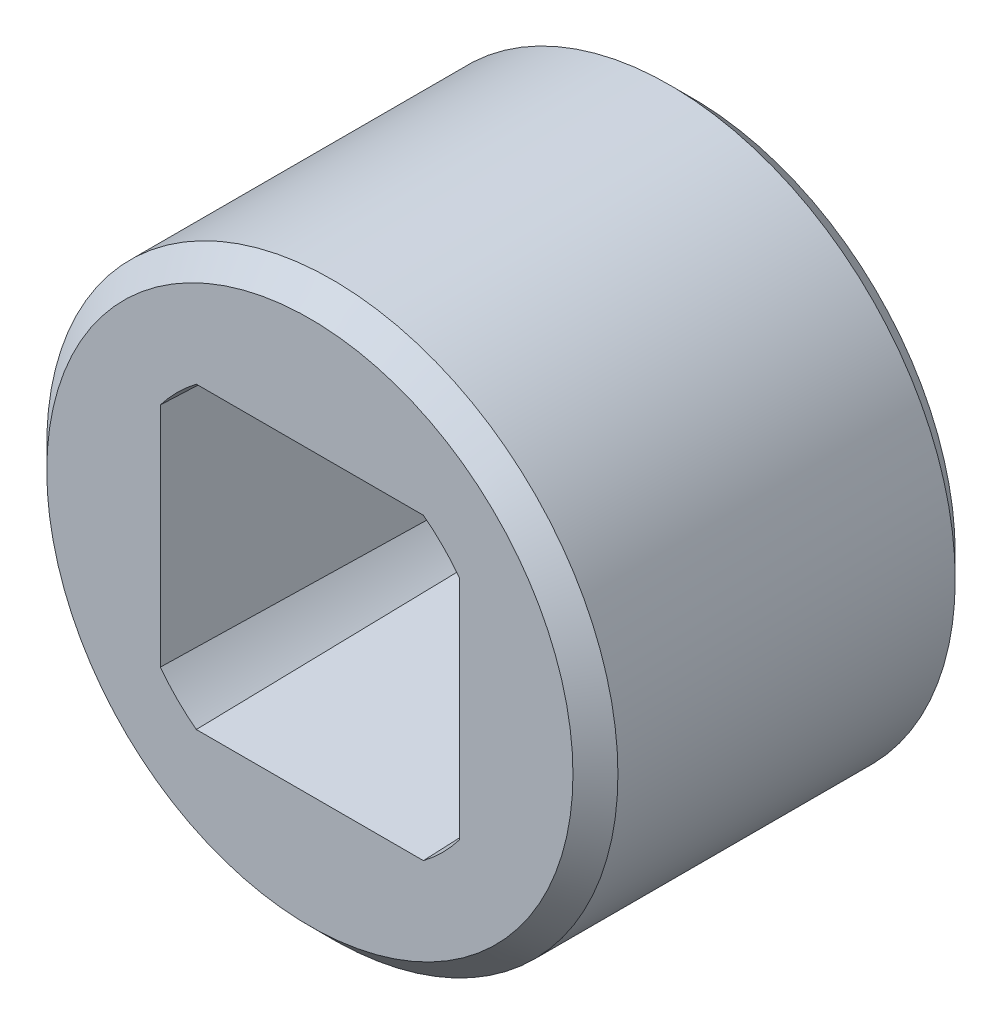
ISO-10303-21;
HEADER;
FILE_DESCRIPTION(('STEP AP214'),'2;1');
FILE_NAME('part.step','',(''),(''),'','','');
FILE_SCHEMA(('AUTOMOTIVE_DESIGN { 1 0 10303 214 1 1 1 1 }'));
ENDSEC;
DATA;
#1=APPLICATION_CONTEXT('core data for automotive mechanical design processes');
#2=APPLICATION_PROTOCOL_DEFINITION('international standard','automotive_design',2000,#1);
#3=PRODUCT_CONTEXT('',#1,'mechanical');
#4=PRODUCT('Part','Part','',(#3));
#5=PRODUCT_RELATED_PRODUCT_CATEGORY('part','',(#4));
#6=PRODUCT_DEFINITION_FORMATION('','',#4);
#7=PRODUCT_DEFINITION_CONTEXT('part definition',#1,'design');
#8=PRODUCT_DEFINITION('design','',#6,#7);
#9=PRODUCT_DEFINITION_SHAPE('','',#8);
#10=(LENGTH_UNIT() NAMED_UNIT(*) SI_UNIT(.MILLI.,.METRE.));
#11=(NAMED_UNIT(*) PLANE_ANGLE_UNIT() SI_UNIT($,.RADIAN.));
#12=(NAMED_UNIT(*) SI_UNIT($,.STERADIAN.) SOLID_ANGLE_UNIT());
#13=UNCERTAINTY_MEASURE_WITH_UNIT(LENGTH_MEASURE(1.E-05),#10,'distance_accuracy_value','');
#14=(GEOMETRIC_REPRESENTATION_CONTEXT(3) GLOBAL_UNCERTAINTY_ASSIGNED_CONTEXT((#13)) GLOBAL_UNIT_ASSIGNED_CONTEXT((#10,
#11,#12)) REPRESENTATION_CONTEXT('',''));
#15=CARTESIAN_POINT('',(0.,0.,0.));
#16=DIRECTION('',(0.,0.,1.));
#17=DIRECTION('',(1.,0.,0.));
#18=AXIS2_PLACEMENT_3D('',#15,#16,#17);
#19=CARTESIAN_POINT('',(146.199596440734,-2.10428862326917,-17.));
#20=DIRECTION('',(0.,0.,1.));
#21=DIRECTION('',(1.,0.,0.));
#22=AXIS2_PLACEMENT_3D('',#19,#20,#21);
#23=CYLINDRICAL_SURFACE('',#22,12.7);
#24=CARTESIAN_POINT('',(146.199596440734,-2.10428862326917,-16.));
#25=DIRECTION('',(0.,0.,1.));
#26=DIRECTION('',(1.,0.,0.));
#27=AXIS2_PLACEMENT_3D('',#24,#25,#26);
#28=CIRCLE('',#27,12.7);
#29=CARTESIAN_POINT('',(158.899596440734,-2.10428862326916,-16.));
#30=VERTEX_POINT('',#29);
#31=EDGE_CURVE('E23',#30,#30,#28,.T.);
#32=ORIENTED_EDGE('',*,*,#31,.T.);
#33=EDGE_LOOP('',(#32));
#34=FACE_BOUND('',#33,.T.);
#35=CARTESIAN_POINT('',(146.199596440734,-2.10428862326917,-1.));
#36=DIRECTION('',(0.,0.,1.));
#37=DIRECTION('',(1.,0.,0.));
#38=AXIS2_PLACEMENT_3D('',#35,#36,#37);
#39=CIRCLE('',#38,12.7);
#40=CARTESIAN_POINT('',(158.899596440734,-2.10428862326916,-1.));
#41=VERTEX_POINT('',#40);
#42=EDGE_CURVE('E218',#41,#41,#39,.F.);
#43=ORIENTED_EDGE('',*,*,#42,.T.);
#44=EDGE_LOOP('',(#43));
#45=FACE_BOUND('',#44,.T.);
#46=ADVANCED_FACE('F16',(#34,#45),#23,.T.);
#47=CARTESIAN_POINT('',(146.199596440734,-2.10428862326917,-17.));
#48=DIRECTION('',(0.,0.,1.));
#49=DIRECTION('',(1.,0.,0.));
#50=AXIS2_PLACEMENT_3D('',#47,#48,#49);
#51=PLANE('',#50);
#52=DIRECTION('',(1.,0.,0.));
#53=VECTOR('',#52,1.);
#54=CARTESIAN_POINT('',(146.199596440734,-8.16063554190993,-17.));
#55=LINE('',#54,#53);
#56=CARTESIAN_POINT('',(141.353816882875,-8.16063554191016,-17.));
#57=VERTEX_POINT('',#56);
#58=CARTESIAN_POINT('',(151.045375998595,-8.16063554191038,-17.));
#59=VERTEX_POINT('',#58);
#60=EDGE_CURVE('E213',#57,#59,#55,.T.);
#61=ORIENTED_EDGE('',*,*,#60,.T.);
#62=CARTESIAN_POINT('',(146.199596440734,-2.10428862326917,-17.));
#63=DIRECTION('',(0.,0.,1.));
#64=DIRECTION('',(1.,0.,0.));
#65=AXIS2_PLACEMENT_3D('',#62,#63,#64);
#66=CIRCLE('',#65,7.75634691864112);
#67=CARTESIAN_POINT('',(152.255943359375,-6.9500681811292,-17.));
#68=VERTEX_POINT('',#67);
#69=EDGE_CURVE('E116',#59,#68,#66,.T.);
#70=ORIENTED_EDGE('',*,*,#69,.T.);
#71=DIRECTION('',(0.,1.,0.));
#72=VECTOR('',#71,1.);
#73=CARTESIAN_POINT('',(152.255943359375,-2.10428862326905,-17.));
#74=LINE('',#73,#72);
#75=CARTESIAN_POINT('',(152.255943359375,2.74149093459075,-17.));
#76=VERTEX_POINT('',#75);
#77=EDGE_CURVE('E224',#68,#76,#74,.T.);
#78=ORIENTED_EDGE('',*,*,#77,.T.);
#79=CARTESIAN_POINT('',(146.199596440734,-2.10428862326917,-17.));
#80=DIRECTION('',(0.,0.,1.));
#81=DIRECTION('',(1.,0.,0.));
#82=AXIS2_PLACEMENT_3D('',#79,#80,#81);
#83=CIRCLE('',#82,7.75634691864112);
#84=CARTESIAN_POINT('',(151.045375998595,3.95205829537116,-17.));
#85=VERTEX_POINT('',#84);
#86=EDGE_CURVE('E30',#76,#85,#83,.T.);
#87=ORIENTED_EDGE('',*,*,#86,.T.);
#88=DIRECTION('',(-1.,0.,0.));
#89=VECTOR('',#88,1.);
#90=CARTESIAN_POINT('',(146.199596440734,3.95205829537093,-17.));
#91=LINE('',#90,#89);
#92=CARTESIAN_POINT('',(141.353816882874,3.95205829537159,-17.));
#93=VERTEX_POINT('',#92);
#94=EDGE_CURVE('E227',#85,#93,#91,.T.);
#95=ORIENTED_EDGE('',*,*,#94,.T.);
#96=CARTESIAN_POINT('',(146.199596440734,-2.10428862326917,-17.));
#97=DIRECTION('',(0.,0.,1.));
#98=DIRECTION('',(1.,0.,0.));
#99=AXIS2_PLACEMENT_3D('',#96,#97,#98);
#100=CIRCLE('',#99,7.75634691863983);
#101=CARTESIAN_POINT('',(140.143249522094,2.74149093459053,-17.));
#102=VERTEX_POINT('',#101);
#103=EDGE_CURVE('E230',#93,#102,#100,.T.);
#104=ORIENTED_EDGE('',*,*,#103,.T.);
#105=DIRECTION('',(0.,-1.,0.));
#106=VECTOR('',#105,1.);
#107=CARTESIAN_POINT('',(140.143249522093,-2.10428862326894,-17.));
#108=LINE('',#107,#106);
#109=CARTESIAN_POINT('',(140.143249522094,-6.95006818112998,-17.));
#110=VERTEX_POINT('',#109);
#111=EDGE_CURVE('E233',#102,#110,#108,.T.);
#112=ORIENTED_EDGE('',*,*,#111,.T.);
#113=CARTESIAN_POINT('',(146.199596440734,-2.10428862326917,-17.));
#114=DIRECTION('',(0.,0.,1.));
#115=DIRECTION('',(1.,0.,0.));
#116=AXIS2_PLACEMENT_3D('',#113,#114,#115);
#117=CIRCLE('',#116,7.75634691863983);
#118=EDGE_CURVE('E236',#110,#57,#117,.T.);
#119=ORIENTED_EDGE('',*,*,#118,.T.);
#120=EDGE_LOOP('',(#61,#70,#78,#87,#95,#104,#112,#119));
#121=FACE_BOUND('',#120,.T.);
#122=CARTESIAN_POINT('',(146.199596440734,-2.10428862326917,-17.));
#123=DIRECTION('',(0.,0.,1.));
#124=DIRECTION('',(1.,0.,0.));
#125=AXIS2_PLACEMENT_3D('',#122,#123,#124);
#126=CIRCLE('',#125,11.7);
#127=CARTESIAN_POINT('',(157.899596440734,-2.10428862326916,-17.));
#128=VERTEX_POINT('',#127);
#129=EDGE_CURVE('E11',#128,#128,#126,.F.);
#130=ORIENTED_EDGE('',*,*,#129,.T.);
#131=EDGE_LOOP('',(#130));
#132=FACE_BOUND('',#131,.T.);
#133=ADVANCED_FACE('F199',(#121,#132),#51,.F.);
#134=CARTESIAN_POINT('',(146.199596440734,-2.10428862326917,0.));
#135=DIRECTION('',(0.,0.,1.));
#136=DIRECTION('',(1.,0.,0.));
#137=AXIS2_PLACEMENT_3D('',#134,#135,#136);
#138=PLANE('',#137);
#139=CARTESIAN_POINT('',(146.199596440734,-2.10428862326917,0.));
#140=DIRECTION('',(0.,0.,1.));
#141=DIRECTION('',(1.,0.,0.));
#142=AXIS2_PLACEMENT_3D('',#139,#140,#141);
#143=CIRCLE('',#142,8.35000000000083);
#144=CARTESIAN_POINT('',(151.249348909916,-8.75428862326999,0.));
#145=VERTEX_POINT('',#144);
#146=CARTESIAN_POINT('',(152.849596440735,-7.15404109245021,0.));
#147=VERTEX_POINT('',#146);
#148=EDGE_CURVE('E38',#145,#147,#143,.T.);
#149=ORIENTED_EDGE('',*,*,#148,.F.);
#150=DIRECTION('',(1.,0.,0.));
#151=VECTOR('',#150,1.);
#152=CARTESIAN_POINT('',(141.149843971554,-8.75428862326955,0.));
#153=LINE('',#152,#151);
#154=CARTESIAN_POINT('',(141.149843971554,-8.75428862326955,0.));
#155=VERTEX_POINT('',#154);
#156=EDGE_CURVE('E113',#155,#145,#153,.T.);
#157=ORIENTED_EDGE('',*,*,#156,.F.);
#158=CARTESIAN_POINT('',(146.199596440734,-2.10428862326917,0.));
#159=DIRECTION('',(0.,0.,1.));
#160=DIRECTION('',(1.,0.,0.));
#161=AXIS2_PLACEMENT_3D('',#158,#159,#160);
#162=CIRCLE('',#161,8.34999999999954);
#163=CARTESIAN_POINT('',(139.549596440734,-7.15404109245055,0.));
#164=VERTEX_POINT('',#163);
#165=EDGE_CURVE('E110',#164,#155,#162,.T.);
#166=ORIENTED_EDGE('',*,*,#165,.F.);
#167=DIRECTION('',(0.,-1.,0.));
#168=VECTOR('',#167,1.);
#169=CARTESIAN_POINT('',(139.549596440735,2.94546384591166,0.));
#170=LINE('',#169,#168);
#171=CARTESIAN_POINT('',(139.549596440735,2.94546384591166,0.));
#172=VERTEX_POINT('',#171);
#173=EDGE_CURVE('E107',#172,#164,#170,.T.);
#174=ORIENTED_EDGE('',*,*,#173,.F.);
#175=CARTESIAN_POINT('',(146.199596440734,-2.10428862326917,0.));
#176=DIRECTION('',(0.,0.,1.));
#177=DIRECTION('',(1.,0.,0.));
#178=AXIS2_PLACEMENT_3D('',#175,#176,#177);
#179=CIRCLE('',#178,8.34999999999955);
#180=CARTESIAN_POINT('',(141.149843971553,4.54571137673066,0.));
#181=VERTEX_POINT('',#180);
#182=EDGE_CURVE('E101',#181,#172,#179,.T.);
#183=ORIENTED_EDGE('',*,*,#182,.F.);
#184=DIRECTION('',(-1.,0.,0.));
#185=VECTOR('',#184,1.);
#186=CARTESIAN_POINT('',(141.149843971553,4.54571137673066,0.));
#187=LINE('',#186,#185);
#188=CARTESIAN_POINT('',(151.249348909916,4.54571137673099,0.));
#189=VERTEX_POINT('',#188);
#190=EDGE_CURVE('E99',#189,#181,#187,.T.);
#191=ORIENTED_EDGE('',*,*,#190,.F.);
#192=CARTESIAN_POINT('',(146.199596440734,-2.10428862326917,0.));
#193=DIRECTION('',(0.,0.,1.));
#194=DIRECTION('',(1.,0.,0.));
#195=AXIS2_PLACEMENT_3D('',#192,#193,#194);
#196=CIRCLE('',#195,8.35000000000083);
#197=CARTESIAN_POINT('',(152.849596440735,2.94546384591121,0.));
#198=VERTEX_POINT('',#197);
#199=EDGE_CURVE('E82',#198,#189,#196,.T.);
#200=ORIENTED_EDGE('',*,*,#199,.F.);
#201=DIRECTION('',(0.,1.,0.));
#202=VECTOR('',#201,1.);
#203=CARTESIAN_POINT('',(152.849596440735,2.94546384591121,0.));
#204=LINE('',#203,#202);
#205=EDGE_CURVE('E91',#147,#198,#204,.T.);
#206=ORIENTED_EDGE('',*,*,#205,.F.);
#207=EDGE_LOOP('',(#149,#157,#166,#174,#183,#191,#200,#206));
#208=FACE_BOUND('',#207,.T.);
#209=CARTESIAN_POINT('',(146.199596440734,-2.10428862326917,0.));
#210=DIRECTION('',(0.,0.,1.));
#211=DIRECTION('',(1.,0.,0.));
#212=AXIS2_PLACEMENT_3D('',#209,#210,#211);
#213=CIRCLE('',#212,11.7);
#214=CARTESIAN_POINT('',(157.899596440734,-2.10428862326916,0.));
#215=VERTEX_POINT('',#214);
#216=EDGE_CURVE('E124',#215,#215,#213,.T.);
#217=ORIENTED_EDGE('',*,*,#216,.T.);
#218=EDGE_LOOP('',(#217));
#219=FACE_BOUND('',#218,.T.);
#220=ADVANCED_FACE('F95',(#208,#219),#138,.T.);
#221=CARTESIAN_POINT('',(146.199596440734,-2.10428862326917,0.));
#222=DIRECTION('',(0.,0.,-1.));
#223=DIRECTION('',(-1.,0.,0.));
#224=AXIS2_PLACEMENT_3D('',#221,#222,#223);
#225=CONICAL_SURFACE('',#224,11.7,0.785398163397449);
#226=ORIENTED_EDGE('',*,*,#42,.F.);
#227=EDGE_LOOP('',(#226));
#228=FACE_BOUND('',#227,.T.);
#229=ORIENTED_EDGE('',*,*,#216,.F.);
#230=EDGE_LOOP('',(#229));
#231=FACE_BOUND('',#230,.T.);
#232=ADVANCED_FACE('F193',(#228,#231),#225,.T.);
#233=CARTESIAN_POINT('',(146.199596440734,-2.10428862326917,-16.));
#234=DIRECTION('',(0.,0.,1.));
#235=DIRECTION('',(1.,0.,0.));
#236=AXIS2_PLACEMENT_3D('',#233,#234,#235);
#237=CONICAL_SURFACE('',#236,12.7,0.785398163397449);
#238=ORIENTED_EDGE('',*,*,#129,.F.);
#239=EDGE_LOOP('',(#238));
#240=FACE_BOUND('',#239,.T.);
#241=ORIENTED_EDGE('',*,*,#31,.F.);
#242=EDGE_LOOP('',(#241));
#243=FACE_BOUND('',#242,.T.);
#244=ADVANCED_FACE('F135',(#240,#243),#237,.T.);
#245=CARTESIAN_POINT('',(146.199596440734,-2.10428862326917,0.));
#246=DIRECTION('',(0.,0.,1.));
#247=DIRECTION('',(1.,0.,0.));
#248=AXIS2_PLACEMENT_3D('',#245,#246,#247);
#249=CONICAL_SURFACE('',#248,8.35000000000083,0.0349065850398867);
#250=ORIENTED_EDGE('',*,*,#148,.T.);
#251=CARTESIAN_POINT('',(152.255943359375,-6.9500681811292,-17.));
#252=CARTESIAN_POINT('',(152.43030642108,-7.01119322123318,-12.0068952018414));
#253=CARTESIAN_POINT('',(152.604669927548,-7.07124717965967,-7.01377766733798));
#254=CARTESIAN_POINT('',(152.802554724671,-7.13818655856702,-1.34709849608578));
#255=CARTESIAN_POINT('',(152.826075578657,-7.14612357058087,-0.673549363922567));
#256=CARTESIAN_POINT('',(152.849596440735,-7.15404109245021,0.));
#257=B_SPLINE_CURVE_WITH_KNOTS('',3,(#251,#252,#253,#254,#255,#256),.UNSPECIFIED.,.F.,.F.,(4,2,
4),(0.,14.9895659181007,17.0115851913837),.UNSPECIFIED.);
#258=EDGE_CURVE('E88',#68,#147,#257,.T.);
#259=ORIENTED_EDGE('',*,*,#258,.F.);
#260=ORIENTED_EDGE('',*,*,#69,.F.);
#261=CARTESIAN_POINT('',(151.045375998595,-8.16063554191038,-17.));
#262=CARTESIAN_POINT('',(151.106501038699,-8.33499860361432,-12.0068952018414));
#263=CARTESIAN_POINT('',(151.166554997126,-8.50936211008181,-7.01377766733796));
#264=CARTESIAN_POINT('',(151.233494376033,-8.70724690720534,-1.34709849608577));
#265=CARTESIAN_POINT('',(151.241431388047,-8.73076776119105,-0.673549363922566));
#266=CARTESIAN_POINT('',(151.249348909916,-8.75428862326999,0.));
#267=B_SPLINE_CURVE_WITH_KNOTS('',3,(#261,#262,#263,#264,#265,#266),.UNSPECIFIED.,.F.,.F.,(4,2,
4),(0.,14.9895659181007,17.0115851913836),.UNSPECIFIED.);
#268=EDGE_CURVE('E117',#59,#145,#267,.T.);
#269=ORIENTED_EDGE('',*,*,#268,.T.);
#270=EDGE_LOOP('',(#250,#259,#260,#269));
#271=FACE_BOUND('',#270,.T.);
#272=ADVANCED_FACE('F132',(#271),#249,.F.);
#273=CARTESIAN_POINT('',(141.149843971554,-8.75428862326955,0.));
#274=DIRECTION('',(0.,-0.999390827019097,-0.034899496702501));
#275=DIRECTION('',(0.,0.0348994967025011,-0.999390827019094));
#276=AXIS2_PLACEMENT_3D('',#273,#274,#275);
#277=PLANE('',#276);
#278=ORIENTED_EDGE('',*,*,#156,.T.);
#279=ORIENTED_EDGE('',*,*,#268,.F.);
#280=ORIENTED_EDGE('',*,*,#60,.F.);
#281=CARTESIAN_POINT('',(141.353816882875,-8.16063554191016,-17.));
#282=CARTESIAN_POINT('',(141.292691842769,-8.33499860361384,-12.0068952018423));
#283=CARTESIAN_POINT('',(141.232637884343,-8.50936211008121,-7.01377766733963));
#284=CARTESIAN_POINT('',(141.165698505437,-8.70724690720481,-1.34709849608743));
#285=CARTESIAN_POINT('',(141.157761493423,-8.73076776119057,-0.673549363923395));
#286=CARTESIAN_POINT('',(141.149843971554,-8.75428862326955,0.));
#287=B_SPLINE_CURVE_WITH_KNOTS('',3,(#281,#282,#283,#284,#285,#286),.UNSPECIFIED.,.F.,.F.,(4,2,
4),(0.,14.9895659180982,17.0115851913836),.UNSPECIFIED.);
#288=EDGE_CURVE('E125',#57,#155,#287,.T.);
#289=ORIENTED_EDGE('',*,*,#288,.T.);
#290=EDGE_LOOP('',(#278,#279,#280,#289));
#291=FACE_BOUND('',#290,.T.);
#292=ADVANCED_FACE('F130',(#291),#277,.F.);
#293=CARTESIAN_POINT('',(146.199596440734,-2.10428862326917,0.));
#294=DIRECTION('',(0.,0.,1.));
#295=DIRECTION('',(1.,0.,0.));
#296=AXIS2_PLACEMENT_3D('',#293,#294,#295);
#297=CONICAL_SURFACE('',#296,8.34999999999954,0.0349065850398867);
#298=ORIENTED_EDGE('',*,*,#165,.T.);
#299=ORIENTED_EDGE('',*,*,#288,.F.);
#300=ORIENTED_EDGE('',*,*,#118,.F.);
#301=CARTESIAN_POINT('',(140.143249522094,-6.95006818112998,-17.));
#302=CARTESIAN_POINT('',(139.968886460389,-7.01119322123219,-12.0068952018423));
#303=CARTESIAN_POINT('',(139.794522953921,-7.07124717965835,-7.01377766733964));
#304=CARTESIAN_POINT('',(139.596638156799,-7.13818655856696,-1.34709849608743));
#305=CARTESIAN_POINT('',(139.573117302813,-7.146123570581,-0.673549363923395));
#306=CARTESIAN_POINT('',(139.549596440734,-7.15404109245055,0.));
#307=B_SPLINE_CURVE_WITH_KNOTS('',3,(#301,#302,#303,#304,#305,#306),.UNSPECIFIED.,.F.,.F.,(4,2,
4),(0.,14.9895659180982,17.0115851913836),.UNSPECIFIED.);
#308=EDGE_CURVE('E176',#110,#164,#307,.T.);
#309=ORIENTED_EDGE('',*,*,#308,.T.);
#310=EDGE_LOOP('',(#298,#299,#300,#309));
#311=FACE_BOUND('',#310,.T.);
#312=ADVANCED_FACE('F185',(#311),#297,.F.);
#313=CARTESIAN_POINT('',(139.549596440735,2.94546384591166,0.));
#314=DIRECTION('',(-0.999390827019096,0.,-0.034899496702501));
#315=DIRECTION('',(-0.0348994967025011,0.,0.999390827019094));
#316=AXIS2_PLACEMENT_3D('',#313,#314,#315);
#317=PLANE('',#316);
#318=ORIENTED_EDGE('',*,*,#173,.T.);
#319=ORIENTED_EDGE('',*,*,#308,.F.);
#320=ORIENTED_EDGE('',*,*,#111,.F.);
#321=CARTESIAN_POINT('',(140.143249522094,2.74149093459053,-17.));
#322=CARTESIAN_POINT('',(139.968886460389,2.80261597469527,-12.0068952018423));
#323=CARTESIAN_POINT('',(139.794522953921,2.86266993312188,-7.01377766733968));
#324=CARTESIAN_POINT('',(139.596638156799,2.92960931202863,-1.34709849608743));
#325=CARTESIAN_POINT('',(139.573117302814,2.9375463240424,-0.673549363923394));
#326=CARTESIAN_POINT('',(139.549596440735,2.94546384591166,0.));
#327=B_SPLINE_CURVE_WITH_KNOTS('',3,(#321,#322,#323,#324,#325,#326),.UNSPECIFIED.,.F.,.F.,(4,2,
4),(0.,14.9895659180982,17.0115851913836),.UNSPECIFIED.);
#328=EDGE_CURVE('E171',#102,#172,#327,.T.);
#329=ORIENTED_EDGE('',*,*,#328,.T.);
#330=EDGE_LOOP('',(#318,#319,#320,#329));
#331=FACE_BOUND('',#330,.T.);
#332=ADVANCED_FACE('F166',(#331),#317,.F.);
#333=CARTESIAN_POINT('',(146.199596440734,-2.10428862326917,0.));
#334=DIRECTION('',(0.,0.,1.));
#335=DIRECTION('',(1.,0.,0.));
#336=AXIS2_PLACEMENT_3D('',#333,#334,#335);
#337=CONICAL_SURFACE('',#336,8.34999999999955,0.0349065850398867);
#338=ORIENTED_EDGE('',*,*,#182,.T.);
#339=ORIENTED_EDGE('',*,*,#328,.F.);
#340=ORIENTED_EDGE('',*,*,#103,.F.);
#341=CARTESIAN_POINT('',(141.353816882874,3.95205829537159,-17.));
#342=CARTESIAN_POINT('',(141.292691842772,4.12642135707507,-12.0068952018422));
#343=CARTESIAN_POINT('',(141.232637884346,4.30078486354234,-7.01377766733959));
#344=CARTESIAN_POINT('',(141.165698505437,4.49866966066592,-1.34709849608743));
#345=CARTESIAN_POINT('',(141.157761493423,4.52219051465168,-0.673549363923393));
#346=CARTESIAN_POINT('',(141.149843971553,4.54571137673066,0.));
#347=B_SPLINE_CURVE_WITH_KNOTS('',3,(#341,#342,#343,#344,#345,#346),.UNSPECIFIED.,.F.,.F.,(4,2,
4),(0.,14.9895659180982,17.0115851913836),.UNSPECIFIED.);
#348=EDGE_CURVE('E151',#93,#181,#347,.T.);
#349=ORIENTED_EDGE('',*,*,#348,.T.);
#350=EDGE_LOOP('',(#338,#339,#340,#349));
#351=FACE_BOUND('',#350,.T.);
#352=ADVANCED_FACE('F160',(#351),#337,.F.);
#353=CARTESIAN_POINT('',(141.149843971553,4.54571137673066,0.));
#354=DIRECTION('',(0.,0.999390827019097,-0.034899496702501));
#355=DIRECTION('',(0.,0.0348994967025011,0.999390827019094));
#356=AXIS2_PLACEMENT_3D('',#353,#354,#355);
#357=PLANE('',#356);
#358=ORIENTED_EDGE('',*,*,#190,.T.);
#359=ORIENTED_EDGE('',*,*,#348,.F.);
#360=ORIENTED_EDGE('',*,*,#94,.F.);
#361=CARTESIAN_POINT('',(151.045375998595,3.95205829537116,-17.));
#362=CARTESIAN_POINT('',(151.106501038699,4.12642135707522,-12.0068952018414));
#363=CARTESIAN_POINT('',(151.166554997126,4.30078486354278,-7.01377766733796));
#364=CARTESIAN_POINT('',(151.233494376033,4.49866966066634,-1.34709849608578));
#365=CARTESIAN_POINT('',(151.241431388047,4.52219051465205,-0.673549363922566));
#366=CARTESIAN_POINT('',(151.249348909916,4.54571137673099,0.));
#367=B_SPLINE_CURVE_WITH_KNOTS('',3,(#361,#362,#363,#364,#365,#366),.UNSPECIFIED.,.F.,.F.,(4,2,
4),(0.,14.9895659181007,17.0115851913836),.UNSPECIFIED.);
#368=EDGE_CURVE('E87',#85,#189,#367,.T.);
#369=ORIENTED_EDGE('',*,*,#368,.T.);
#370=EDGE_LOOP('',(#358,#359,#360,#369));
#371=FACE_BOUND('',#370,.T.);
#372=ADVANCED_FACE('F157',(#371),#357,.F.);
#373=CARTESIAN_POINT('',(146.199596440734,-2.10428862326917,0.));
#374=DIRECTION('',(0.,0.,1.));
#375=DIRECTION('',(1.,0.,0.));
#376=AXIS2_PLACEMENT_3D('',#373,#374,#375);
#377=CONICAL_SURFACE('',#376,8.35000000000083,0.0349065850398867);
#378=ORIENTED_EDGE('',*,*,#199,.T.);
#379=ORIENTED_EDGE('',*,*,#368,.F.);
#380=ORIENTED_EDGE('',*,*,#86,.F.);
#381=CARTESIAN_POINT('',(152.255943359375,2.74149093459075,-17.));
#382=CARTESIAN_POINT('',(152.43030642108,2.80261597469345,-12.0068952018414));
#383=CARTESIAN_POINT('',(152.604669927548,2.86266993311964,-7.01377766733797));
#384=CARTESIAN_POINT('',(152.802554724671,2.92960931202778,-1.34709849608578));
#385=CARTESIAN_POINT('',(152.826075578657,2.93754632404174,-0.673549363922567));
#386=CARTESIAN_POINT('',(152.849596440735,2.94546384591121,0.));
#387=B_SPLINE_CURVE_WITH_KNOTS('',3,(#381,#382,#383,#384,#385,#386),.UNSPECIFIED.,.F.,.F.,(4,2,
4),(0.,14.9895659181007,17.0115851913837),.UNSPECIFIED.);
#388=EDGE_CURVE('E78',#76,#198,#387,.T.);
#389=ORIENTED_EDGE('',*,*,#388,.T.);
#390=EDGE_LOOP('',(#378,#379,#380,#389));
#391=FACE_BOUND('',#390,.T.);
#392=ADVANCED_FACE('F80',(#391),#377,.F.);
#393=CARTESIAN_POINT('',(152.849596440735,2.94546384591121,0.));
#394=DIRECTION('',(0.999390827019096,0.,-0.034899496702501));
#395=DIRECTION('',(-0.0348994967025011,0.,-0.999390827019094));
#396=AXIS2_PLACEMENT_3D('',#393,#394,#395);
#397=PLANE('',#396);
#398=ORIENTED_EDGE('',*,*,#205,.T.);
#399=ORIENTED_EDGE('',*,*,#388,.F.);
#400=ORIENTED_EDGE('',*,*,#77,.F.);
#401=ORIENTED_EDGE('',*,*,#258,.T.);
#402=EDGE_LOOP('',(#398,#399,#400,#401));
#403=FACE_BOUND('',#402,.T.);
#404=ADVANCED_FACE('F92',(#403),#397,.F.);
#405=CLOSED_SHELL('',(#46,#133,#220,#232,#244,#272,#292,#312,#332,#352,#372,#392,#404));
#406=MANIFOLD_SOLID_BREP('B1',#405);
#407=ADVANCED_BREP_SHAPE_REPRESENTATION('',(#18,#406),#14);
#408=SHAPE_DEFINITION_REPRESENTATION(#9,#407);
ENDSEC;
END-ISO-10303-21;
